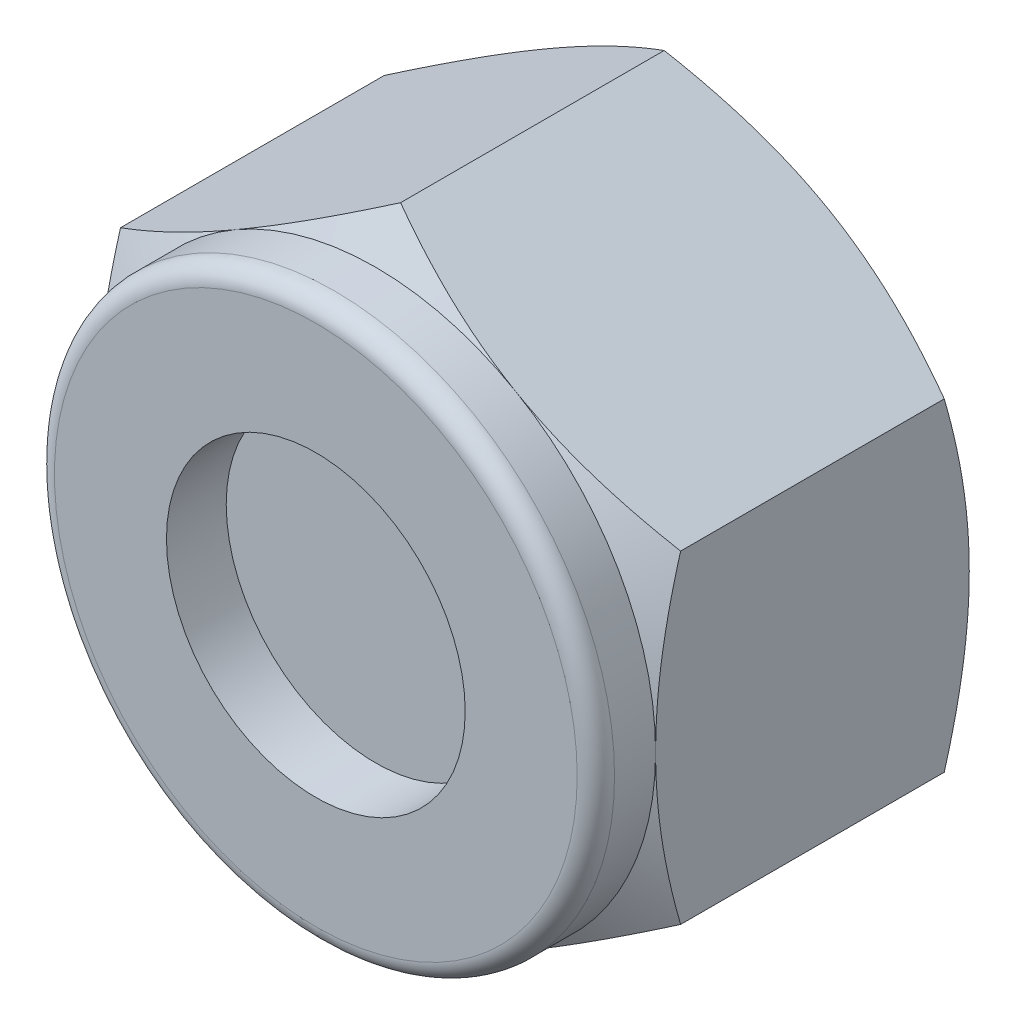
from build123d import *

# Parameters (mm, degrees)
ESQUISSE1_R          = 7.5
ESQUISSE1_R_2        = 4
BASE_EXTRUSION_DEPTH = 10
BOSS_EXTRU_1_DEPTH   = 8.4
CONG_1_R             = 0.5


with BuildPart() as part:
    # Esquisse1 → Base-Extrusion (new body)
    with BuildSketch(Plane.XY):
        Circle(ESQUISSE1_R)
        with Locations(Location((0, 0, 0), (0, 0, 180))):
            Circle(ESQUISSE1_R_2, mode=Mode.SUBTRACT)
    extrude(amount=BASE_EXTRUSION_DEPTH)

    # Esquisse2 → Boss.-Extru.1 (add)
    with BuildSketch(Plane.XY):
        Polygon((7.5, 4.330127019), (7.5, -4.330127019), (0, -8.660254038), (-7.5, -4.330127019), (-7.5, 4.330127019), (0, 8.660254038), align=None)
    extrude(amount=BOSS_EXTRU_1_DEPTH)

    # Esquisse4 → Enl_vement de mati_re-R_volution2 (revolve, cut)
    with BuildSketch(Plane(origin=(0, 0, 0), x_dir=(1, 0, 0), z_dir=(0, 1, 0))):
        Polygon((7.5, 0), (15, 0), (15, -8.4), (7.5, -8.4), (13, -5.224573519), (13, -3.175426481), align=None)
    revolve(axis=Axis((0, 0, -17), (0, 0, 1)), mode=Mode.SUBTRACT)

    # Cong_1
    cong_1_edges = [part.edges().sort_by_distance(p)[0] for p in [
        (-7.5, 0, 10),
    ]]
    fillet(cong_1_edges, radius=CONG_1_R)


solid = part.part
